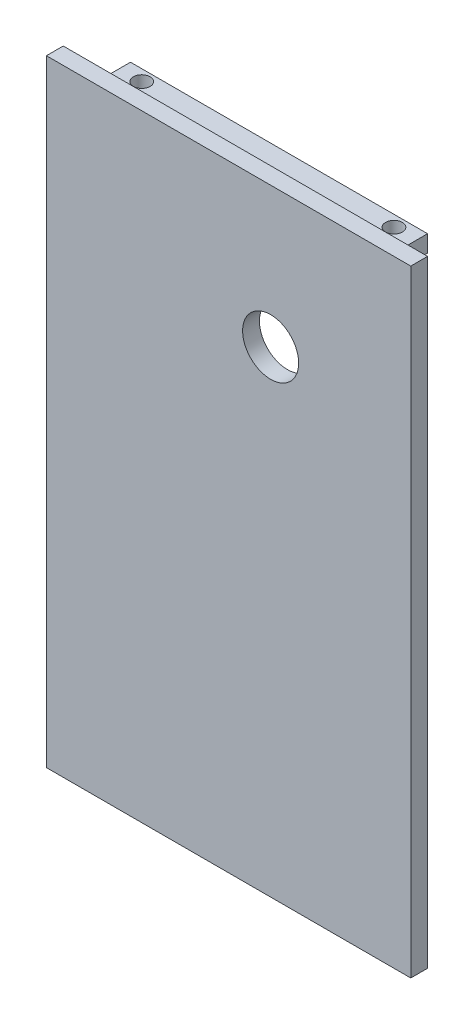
from build123d import *

# Parameters (mm, degrees)
SKETCH1_W           = 65
SKETCH1_H           = 110
BOSS_EXTRUDE1_DEPTH = 3
BOSS_EXTRUDE2_DEPTH = 65
SKETCH5_W           = 6
SKETCH5_H           = 6
CUT_EXTRUDE1_DEPTH  = 113.465550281
SKETCH7_R           = 5
CUT_EXTRUDE3_DEPTH  = 65.515502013
SKETCH8_R           = 1.5
CUT_EXTRUDE4_DEPTH  = 113.465550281


with BuildPart() as part:
    # Sketch1 → Boss-Extrude1 (new body)
    with BuildSketch(Plane.XY):
        Rectangle(SKETCH1_W, SKETCH1_H)
    extrude(amount=BOSS_EXTRUDE1_DEPTH)

    # Sketch3 → Boss-Extrude2 (add, through all)
    with BuildSketch(Plane.ZY.offset(32.5)):
        Polygon((3, -55), (0, -55), (0, -52.5), (-6, -52.5), (-6, -49.5), (0, -49.5), (0, 49.5), (-6, 49.5), (-6, 52.5), (0, 52.5), (0, 55), (3, 55), align=None)
    extrude(amount=-BOSS_EXTRUDE2_DEPTH)

    # Sketch5 → Cut-Extrude1 (cut, through all)
    with BuildSketch(Plane(origin=(0, -52.5, 0), x_dir=(-1, 0, 0), z_dir=(0, -1, 0))):
        with Locations((29.5, 3)):
            Rectangle(SKETCH5_W, SKETCH5_H)
        with Locations((-29.5, 3)):
            Rectangle(SKETCH5_W, SKETCH5_H)
    extrude(amount=-CUT_EXTRUDE1_DEPTH, mode=Mode.SUBTRACT)

    # Sketch7 → Cut-Extrude3 (cut, through all)
    with BuildSketch(Plane.XY.offset(3)):
        with Locations((7.5, 30)):
            Circle(SKETCH7_R)
    extrude(amount=-CUT_EXTRUDE3_DEPTH, mode=Mode.SUBTRACT)

    # Sketch8 → Cut-Extrude4 (cut, through all)
    with BuildSketch(Plane(origin=(0, 52.5, 0), x_dir=(1, 0, 0), z_dir=(0, 1, 0))):
        with Locations(Location((-22.5, 4, 0), (0, 0, 180))):
            Circle(SKETCH8_R)
        with Locations(Location((22.5, 4, 0), (0, 0, 180))):
            Circle(SKETCH8_R)
    extrude(amount=-CUT_EXTRUDE4_DEPTH, mode=Mode.SUBTRACT)


solid = part.part
